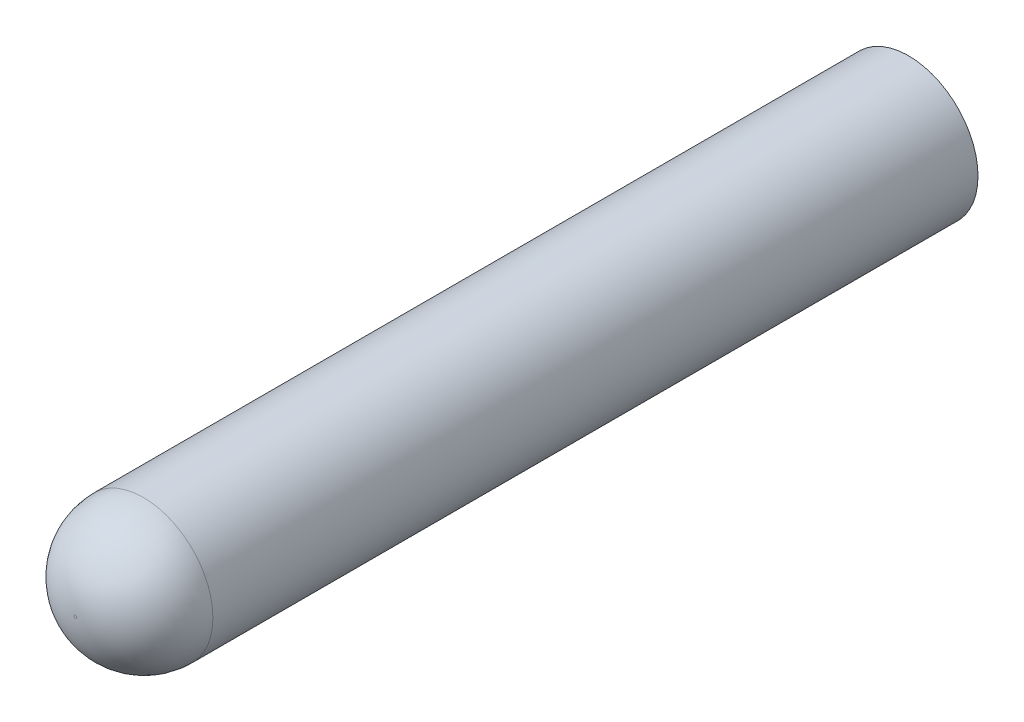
from build123d import *

# Parameters (mm, degrees)
SKETCH1_R           = 0.5
BOSS_EXTRUDE1_DEPTH = 6
FILLET1_R           = 0.49


with BuildPart() as part:
    # Sketch1 → Boss-Extrude1 (new body)
    with BuildSketch(Plane.XY):
        Circle(SKETCH1_R)
    extrude(amount=BOSS_EXTRUDE1_DEPTH)

    # Fillet1
    fillet1_edges = [part.edges().sort_by_distance(p)[0] for p in [
        (-0.5, 0, 6),
    ]]
    fillet(fillet1_edges, radius=FILLET1_R)


solid = part.part
